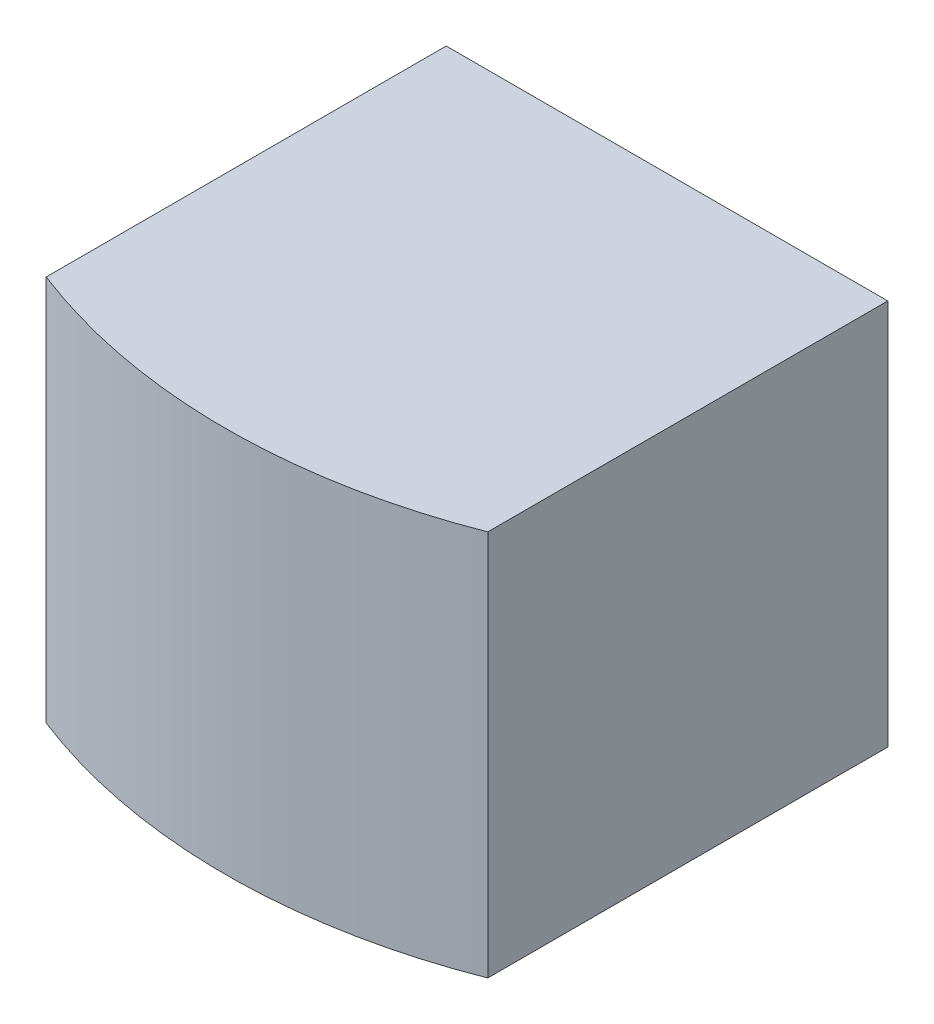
from build123d import *

# Parameters (mm, degrees)
CUT_EXTRUDE1_DEPTH = 217.645770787


with BuildPart() as part:
    # Sketch1 → Revolve1 (revolve)
    with BuildSketch(Plane.XY, mode=Mode.PRIVATE) as revolve1_sk:
        Polygon((-12.7, 2.54), (-12.7, 78.74), (-25.4, 78.74), (-38.1, 91.44), (-139.7, 91.44), (-139.7, 2.54), align=None)
    revolve(revolve1_sk.sketch.rotate(Axis((0, 0, 0), (0, 1, 0)), 270), axis=Axis((0, 0, 0), (0, 1, 0)))

    # Sketch2 → Cut-Extrude1 (cut, through all)
    with BuildSketch(Plane.XZ.offset(-91.44)):
        with BuildLine():
            Line((50.8, 50.8), (50.8, 138.447883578))
            ThreePointArc((50.8, 138.447883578), (0, -147.473578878), (-50.8, 138.447883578))
            Line((-50.8, 138.447883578), (-50.8, 38.1))
            Line((-50.8, 38.1), (50.8, 38.1))
            Line((50.8, 38.1), (50.8, 50.8))
        make_face()
    extrude(amount=CUT_EXTRUDE1_DEPTH, mode=Mode.SUBTRACT)


solid = part.part
